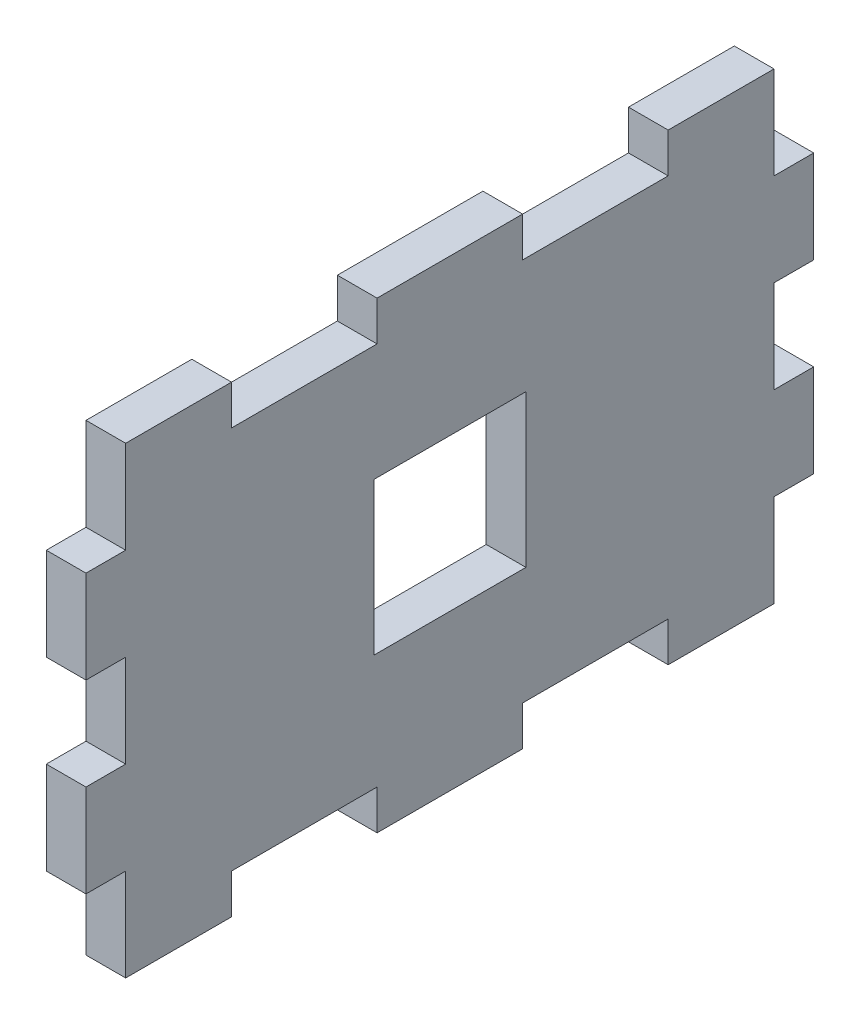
from build123d import *

# Parameters (mm, degrees)
SKETCH1_W           = 55
SKETCH1_H           = 35
BOSS_EXTRUDE1_DEPTH = 3
SKETCH3_W           = 11
SKETCH3_H           = 3
CUT_EXTRUDE1_DEPTH  = 3
SKETCH4_W           = 3
SKETCH4_H           = 7
CUT_EXTRUDE2_DEPTH  = 3
SKETCH5_W           = 11.5
SKETCH5_H           = 11.5
CUT_EXTRUDE3_DEPTH  = 41


with BuildPart() as part:
    # Sketch1 → Boss-Extrude1 (new body)
    with BuildSketch(Plane(origin=(0, 0, 0), x_dir=(0, 0, -1), z_dir=(1, 0, 0))):
        Rectangle(SKETCH1_W, SKETCH1_H)
    extrude(amount=BOSS_EXTRUDE1_DEPTH)

    # Sketch3 → Cut-Extrude1 (cut)
    with BuildSketch(Plane(origin=(3, 0, 0), x_dir=(0, 0, -1), z_dir=(1, 0, 0))):
        with Locations((-11, 16)):
            Rectangle(SKETCH3_W, SKETCH3_H)
        with Locations((11, 16)):
            Rectangle(SKETCH3_W, SKETCH3_H)
        with Locations((11, -16)):
            Rectangle(SKETCH3_W, SKETCH3_H)
        with Locations((-11, -16)):
            Rectangle(SKETCH3_W, SKETCH3_H)
    extrude(amount=-CUT_EXTRUDE1_DEPTH, mode=Mode.SUBTRACT)

    # Sketch4 → Cut-Extrude2 (cut)
    with BuildSketch(Plane(origin=(3, 0, 0), x_dir=(0, 0, -1), z_dir=(1, 0, 0))):
        with Locations((-26, 14)):
            Rectangle(SKETCH4_W, SKETCH4_H)
        with Locations((-26, 0)):
            Rectangle(SKETCH4_W, SKETCH4_H)
        with Locations((-26, -14)):
            Rectangle(SKETCH4_W, SKETCH4_H)
        with Locations((26, 14)):
            Rectangle(SKETCH4_W, SKETCH4_H)
        with Locations((26, 0)):
            Rectangle(SKETCH4_W, SKETCH4_H)
        with Locations((26, -14)):
            Rectangle(SKETCH4_W, SKETCH4_H)
    extrude(amount=-CUT_EXTRUDE2_DEPTH, mode=Mode.SUBTRACT)

    # Sketch5 → Cut-Extrude3 (cut)
    with BuildSketch(Plane(origin=(3, 0, 0), x_dir=(0, 0, -1), z_dir=(1, 0, 0))):
        Rectangle(SKETCH5_W, SKETCH5_H)
    extrude(amount=-CUT_EXTRUDE3_DEPTH, mode=Mode.SUBTRACT)


solid = part.part
